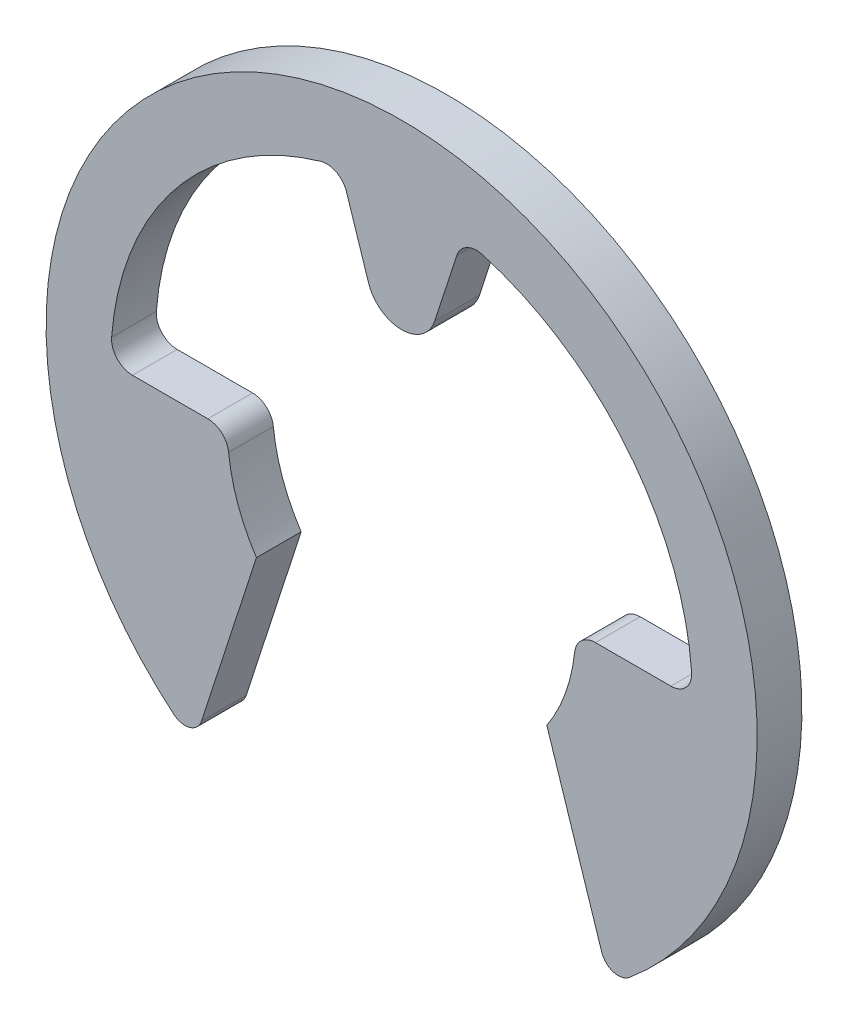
ISO-10303-21;
HEADER;
FILE_DESCRIPTION(('STEP AP214'),'2;1');
FILE_NAME('part.step','',(''),(''),'','','');
FILE_SCHEMA(('AUTOMOTIVE_DESIGN { 1 0 10303 214 1 1 1 1 }'));
ENDSEC;
DATA;
#1=APPLICATION_CONTEXT('core data for automotive mechanical design processes');
#2=APPLICATION_PROTOCOL_DEFINITION('international standard','automotive_design',2000,#1);
#3=PRODUCT_CONTEXT('',#1,'mechanical');
#4=PRODUCT('Part','Part','',(#3));
#5=PRODUCT_RELATED_PRODUCT_CATEGORY('part','',(#4));
#6=PRODUCT_DEFINITION_FORMATION('','',#4);
#7=PRODUCT_DEFINITION_CONTEXT('part definition',#1,'design');
#8=PRODUCT_DEFINITION('design','',#6,#7);
#9=PRODUCT_DEFINITION_SHAPE('','',#8);
#10=(LENGTH_UNIT() NAMED_UNIT(*) SI_UNIT(.MILLI.,.METRE.));
#11=(NAMED_UNIT(*) PLANE_ANGLE_UNIT() SI_UNIT($,.RADIAN.));
#12=(NAMED_UNIT(*) SI_UNIT($,.STERADIAN.) SOLID_ANGLE_UNIT());
#13=UNCERTAINTY_MEASURE_WITH_UNIT(LENGTH_MEASURE(1.E-05),#10,'distance_accuracy_value','');
#14=(GEOMETRIC_REPRESENTATION_CONTEXT(3) GLOBAL_UNCERTAINTY_ASSIGNED_CONTEXT((#13)) GLOBAL_UNIT_ASSIGNED_CONTEXT((#10,
#11,#12)) REPRESENTATION_CONTEXT('',''));
#15=CARTESIAN_POINT('',(0.,0.,0.));
#16=DIRECTION('',(0.,0.,1.));
#17=DIRECTION('',(1.,0.,0.));
#18=AXIS2_PLACEMENT_3D('',#15,#16,#17);
#19=CARTESIAN_POINT('',(-4.35728373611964,-5.22054388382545,0.));
#20=DIRECTION('',(0.,0.,-1.));
#21=DIRECTION('',(-1.,0.,0.));
#22=AXIS2_PLACEMENT_3D('',#19,#20,#21);
#23=PLANE('',#22);
#24=CARTESIAN_POINT('',(4.35728373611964,-5.22054388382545,0.));
#25=DIRECTION('',(0.,0.,-1.));
#26=DIRECTION('',(-1.,0.,0.));
#27=AXIS2_PLACEMENT_3D('',#24,#25,#26);
#28=CIRCLE('',#27,0.35);
#29=CARTESIAN_POINT('',(4.02441395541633,-5.32869983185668,0.));
#30=VERTEX_POINT('',#29);
#31=CARTESIAN_POINT('',(4.58155569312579,-5.48924834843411,0.));
#32=VERTEX_POINT('',#31);
#33=EDGE_CURVE('E164',#30,#32,#28,.F.);
#34=ORIENTED_EDGE('',*,*,#33,.F.);
#35=DIRECTION('',(-0.309016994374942,0.951056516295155,0.));
#36=VECTOR('',#35,1.);
#37=CARTESIAN_POINT('',(2.92,-1.92966318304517,0.));
#38=LINE('',#37,#36);
#39=CARTESIAN_POINT('',(2.92,-1.92966318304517,0.));
#40=VERTEX_POINT('',#39);
#41=EDGE_CURVE('E162',#30,#40,#38,.T.);
#42=ORIENTED_EDGE('',*,*,#41,.T.);
#43=CARTESIAN_POINT('',(0.,0.,0.));
#44=DIRECTION('',(0.,0.,-1.));
#45=DIRECTION('',(-1.,0.,0.));
#46=AXIS2_PLACEMENT_3D('',#43,#44,#45);
#47=CIRCLE('',#46,3.5);
#48=CARTESIAN_POINT('',(3.47985272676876,-0.375,0.));
#49=VERTEX_POINT('',#48);
#50=EDGE_CURVE('E20',#40,#49,#47,.F.);
#51=ORIENTED_EDGE('',*,*,#50,.T.);
#52=CARTESIAN_POINT('',(3.89743505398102,-0.42,0.));
#53=DIRECTION('',(0.,0.,-1.));
#54=DIRECTION('',(-1.,0.,0.));
#55=AXIS2_PLACEMENT_3D('',#52,#53,#54);
#56=CIRCLE('',#55,0.42);
#57=CARTESIAN_POINT('',(3.89743505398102,0.,0.));
#58=VERTEX_POINT('',#57);
#59=EDGE_CURVE('E160',#49,#58,#56,.T.);
#60=ORIENTED_EDGE('',*,*,#59,.T.);
#61=DIRECTION('',(-1.,0.,0.));
#62=VECTOR('',#61,1.);
#63=CARTESIAN_POINT('',(-4.35728373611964,0.,0.));
#64=LINE('',#63,#62);
#65=CARTESIAN_POINT('',(5.41373253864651,0.,0.));
#66=VERTEX_POINT('',#65);
#67=EDGE_CURVE('E235',#58,#66,#64,.F.);
#68=ORIENTED_EDGE('',*,*,#67,.T.);
#69=CARTESIAN_POINT('',(5.41373253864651,0.42,0.));
#70=DIRECTION('',(0.,0.,-1.));
#71=DIRECTION('',(-1.,0.,0.));
#72=AXIS2_PLACEMENT_3D('',#69,#70,#71);
#73=CIRCLE('',#72,0.42);
#74=CARTESIAN_POINT('',(5.83247428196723,0.452486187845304,0.));
#75=VERTEX_POINT('',#74);
#76=EDGE_CURVE('E233',#66,#75,#73,.F.);
#77=ORIENTED_EDGE('',*,*,#76,.T.);
#78=CARTESIAN_POINT('',(0.,0.,0.));
#79=DIRECTION('',(0.,0.,-1.));
#80=DIRECTION('',(-1.,0.,0.));
#81=AXIS2_PLACEMENT_3D('',#78,#79,#80);
#82=CIRCLE('',#81,5.85);
#83=CARTESIAN_POINT('',(1.62452889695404,5.61991155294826,0.));
#84=VERTEX_POINT('',#83);
#85=EDGE_CURVE('E230',#75,#84,#82,.F.);
#86=ORIENTED_EDGE('',*,*,#85,.T.);
#87=CARTESIAN_POINT('',(1.50789605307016,5.21643072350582,0.));
#88=DIRECTION('',(0.,0.,-1.));
#89=DIRECTION('',(-1.,0.,0.));
#90=AXIS2_PLACEMENT_3D('',#87,#88,#89);
#91=CIRCLE('',#90,0.42);
#92=CARTESIAN_POINT('',(1.10845231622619,5.34621786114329,0.));
#93=VERTEX_POINT('',#92);
#94=EDGE_CURVE('E226',#84,#93,#91,.F.);
#95=ORIENTED_EDGE('',*,*,#94,.T.);
#96=DIRECTION('',(-0.309016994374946,-0.951056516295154,0.));
#97=VECTOR('',#96,1.);
#98=CARTESIAN_POINT('',(0.665739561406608,3.98368810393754,0.));
#99=LINE('',#98,#97);
#100=CARTESIAN_POINT('',(0.665739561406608,3.98368810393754,0.));
#101=VERTEX_POINT('',#100);
#102=EDGE_CURVE('E225',#93,#101,#99,.T.);
#103=ORIENTED_EDGE('',*,*,#102,.T.);
#104=CARTESIAN_POINT('',(0.,4.2,0.));
#105=DIRECTION('',(0.,0.,-1.));
#106=DIRECTION('',(-1.,0.,0.));
#107=AXIS2_PLACEMENT_3D('',#104,#105,#106);
#108=CIRCLE('',#107,0.7);
#109=CARTESIAN_POINT('',(-0.665739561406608,3.98368810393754,0.));
#110=VERTEX_POINT('',#109);
#111=EDGE_CURVE('E221',#110,#101,#108,.F.);
#112=ORIENTED_EDGE('',*,*,#111,.F.);
#113=DIRECTION('',(-0.309016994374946,0.951056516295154,0.));
#114=VECTOR('',#113,1.);
#115=CARTESIAN_POINT('',(-0.665739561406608,3.98368810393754,0.));
#116=LINE('',#115,#114);
#117=CARTESIAN_POINT('',(-1.10845231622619,5.34621786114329,0.));
#118=VERTEX_POINT('',#117);
#119=EDGE_CURVE('E215',#110,#118,#116,.T.);
#120=ORIENTED_EDGE('',*,*,#119,.T.);
#121=CARTESIAN_POINT('',(-1.50789605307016,5.21643072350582,0.));
#122=DIRECTION('',(0.,0.,-1.));
#123=DIRECTION('',(-1.,0.,0.));
#124=AXIS2_PLACEMENT_3D('',#121,#122,#123);
#125=CIRCLE('',#124,0.42);
#126=CARTESIAN_POINT('',(-1.62452889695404,5.61991155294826,0.));
#127=VERTEX_POINT('',#126);
#128=EDGE_CURVE('E211',#118,#127,#125,.F.);
#129=ORIENTED_EDGE('',*,*,#128,.T.);
#130=CARTESIAN_POINT('',(0.,0.,0.));
#131=DIRECTION('',(0.,0.,-1.));
#132=DIRECTION('',(-1.,0.,0.));
#133=AXIS2_PLACEMENT_3D('',#130,#131,#132);
#134=CIRCLE('',#133,5.85);
#135=CARTESIAN_POINT('',(-5.83247428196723,0.452486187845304,0.));
#136=VERTEX_POINT('',#135);
#137=EDGE_CURVE('E207',#127,#136,#134,.F.);
#138=ORIENTED_EDGE('',*,*,#137,.T.);
#139=CARTESIAN_POINT('',(-5.41373253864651,0.42,0.));
#140=DIRECTION('',(0.,0.,-1.));
#141=DIRECTION('',(-1.,0.,0.));
#142=AXIS2_PLACEMENT_3D('',#139,#140,#141);
#143=CIRCLE('',#142,0.42);
#144=CARTESIAN_POINT('',(-5.41373253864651,0.,0.));
#145=VERTEX_POINT('',#144);
#146=EDGE_CURVE('E203',#136,#145,#143,.F.);
#147=ORIENTED_EDGE('',*,*,#146,.T.);
#148=DIRECTION('',(1.,0.,0.));
#149=VECTOR('',#148,1.);
#150=CARTESIAN_POINT('',(-3.5,0.,0.));
#151=LINE('',#150,#149);
#152=CARTESIAN_POINT('',(-3.89743505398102,0.,0.));
#153=VERTEX_POINT('',#152);
#154=EDGE_CURVE('E202',#145,#153,#151,.T.);
#155=ORIENTED_EDGE('',*,*,#154,.T.);
#156=CARTESIAN_POINT('',(-3.89743505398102,-0.42,0.));
#157=DIRECTION('',(0.,0.,-1.));
#158=DIRECTION('',(-1.,0.,0.));
#159=AXIS2_PLACEMENT_3D('',#156,#157,#158);
#160=CIRCLE('',#159,0.42);
#161=CARTESIAN_POINT('',(-3.47985272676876,-0.375000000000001,0.));
#162=VERTEX_POINT('',#161);
#163=EDGE_CURVE('E198',#162,#153,#160,.F.);
#164=ORIENTED_EDGE('',*,*,#163,.F.);
#165=CARTESIAN_POINT('',(0.,0.,0.));
#166=DIRECTION('',(0.,0.,-1.));
#167=DIRECTION('',(-1.,0.,0.));
#168=AXIS2_PLACEMENT_3D('',#165,#166,#167);
#169=CIRCLE('',#168,3.5);
#170=CARTESIAN_POINT('',(-2.92,-1.92966318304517,0.));
#171=VERTEX_POINT('',#170);
#172=EDGE_CURVE('E192',#162,#171,#169,.F.);
#173=ORIENTED_EDGE('',*,*,#172,.T.);
#174=DIRECTION('',(-0.309016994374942,-0.951056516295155,0.));
#175=VECTOR('',#174,1.);
#176=CARTESIAN_POINT('',(-2.92,-1.92966318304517,0.));
#177=LINE('',#176,#175);
#178=CARTESIAN_POINT('',(-4.02441395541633,-5.32869983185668,0.));
#179=VERTEX_POINT('',#178);
#180=EDGE_CURVE('E191',#171,#179,#177,.T.);
#181=ORIENTED_EDGE('',*,*,#180,.T.);
#182=CARTESIAN_POINT('',(-4.35728373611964,-5.22054388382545,0.));
#183=DIRECTION('',(0.,0.,-1.));
#184=DIRECTION('',(-1.,0.,0.));
#185=AXIS2_PLACEMENT_3D('',#182,#183,#184);
#186=CIRCLE('',#185,0.35);
#187=CARTESIAN_POINT('',(-4.58155569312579,-5.48924834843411,0.));
#188=VERTEX_POINT('',#187);
#189=EDGE_CURVE('E187',#188,#179,#186,.F.);
#190=ORIENTED_EDGE('',*,*,#189,.F.);
#191=CARTESIAN_POINT('',(0.,0.,0.));
#192=DIRECTION('',(0.,0.,-1.));
#193=DIRECTION('',(-1.,0.,0.));
#194=AXIS2_PLACEMENT_3D('',#191,#192,#193);
#195=CIRCLE('',#194,7.15);
#196=EDGE_CURVE('E184',#32,#188,#195,.F.);
#197=ORIENTED_EDGE('',*,*,#196,.F.);
#198=EDGE_LOOP('',(#34,#42,#51,#60,#68,#77,#86,#95,#103,#112,#120,#129,#138,#147,#155,#164,#173,
#181,#190,#197));
#199=FACE_BOUND('',#198,.T.);
#200=ADVANCED_FACE('F17',(#199),#23,.T.);
#201=CARTESIAN_POINT('',(5.41373253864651,0.42,0.9));
#202=DIRECTION('',(0.,0.,-1.));
#203=DIRECTION('',(-1.,0.,0.));
#204=AXIS2_PLACEMENT_3D('',#201,#202,#203);
#205=CYLINDRICAL_SURFACE('',#204,0.42);
#206=DIRECTION('',(0.,0.,-1.));
#207=VECTOR('',#206,1.);
#208=CARTESIAN_POINT('',(5.83247428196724,0.452486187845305,0.9));
#209=LINE('',#208,#207);
#210=CARTESIAN_POINT('',(5.83247428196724,0.452486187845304,0.9));
#211=VERTEX_POINT('',#210);
#212=EDGE_CURVE('E231',#211,#75,#209,.T.);
#213=ORIENTED_EDGE('',*,*,#212,.T.);
#214=ORIENTED_EDGE('',*,*,#76,.F.);
#215=DIRECTION('',(0.,0.,-1.));
#216=VECTOR('',#215,1.);
#217=CARTESIAN_POINT('',(5.41373253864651,0.,0.9));
#218=LINE('',#217,#216);
#219=CARTESIAN_POINT('',(5.41373253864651,0.,0.9));
#220=VERTEX_POINT('',#219);
#221=EDGE_CURVE('E174',#66,#220,#218,.F.);
#222=ORIENTED_EDGE('',*,*,#221,.T.);
#223=CARTESIAN_POINT('',(5.41373253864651,0.42,0.9));
#224=DIRECTION('',(0.,0.,-1.));
#225=DIRECTION('',(-1.,0.,0.));
#226=AXIS2_PLACEMENT_3D('',#223,#224,#225);
#227=CIRCLE('',#226,0.42);
#228=EDGE_CURVE('E283',#220,#211,#227,.F.);
#229=ORIENTED_EDGE('',*,*,#228,.T.);
#230=EDGE_LOOP('',(#213,#214,#222,#229));
#231=FACE_BOUND('',#230,.T.);
#232=ADVANCED_FACE('F369',(#231),#205,.F.);
#233=CARTESIAN_POINT('',(0.,0.,0.9));
#234=DIRECTION('',(0.,0.,-1.));
#235=DIRECTION('',(-1.,0.,0.));
#236=AXIS2_PLACEMENT_3D('',#233,#234,#235);
#237=CYLINDRICAL_SURFACE('',#236,5.85);
#238=DIRECTION('',(0.,0.,-1.));
#239=VECTOR('',#238,1.);
#240=CARTESIAN_POINT('',(1.62452889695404,5.61991155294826,0.9));
#241=LINE('',#240,#239);
#242=CARTESIAN_POINT('',(1.62452889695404,5.61991155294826,0.9));
#243=VERTEX_POINT('',#242);
#244=EDGE_CURVE('E227',#243,#84,#241,.T.);
#245=ORIENTED_EDGE('',*,*,#244,.T.);
#246=ORIENTED_EDGE('',*,*,#85,.F.);
#247=ORIENTED_EDGE('',*,*,#212,.F.);
#248=CARTESIAN_POINT('',(0.,0.,0.9));
#249=DIRECTION('',(0.,0.,-1.));
#250=DIRECTION('',(-1.,0.,0.));
#251=AXIS2_PLACEMENT_3D('',#248,#249,#250);
#252=CIRCLE('',#251,5.85);
#253=EDGE_CURVE('E280',#211,#243,#252,.F.);
#254=ORIENTED_EDGE('',*,*,#253,.T.);
#255=EDGE_LOOP('',(#245,#246,#247,#254));
#256=FACE_BOUND('',#255,.T.);
#257=ADVANCED_FACE('F367',(#256),#237,.F.);
#258=CARTESIAN_POINT('',(1.50789605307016,5.21643072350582,0.9));
#259=DIRECTION('',(0.,0.,-1.));
#260=DIRECTION('',(-1.,0.,0.));
#261=AXIS2_PLACEMENT_3D('',#258,#259,#260);
#262=CYLINDRICAL_SURFACE('',#261,0.42);
#263=DIRECTION('',(0.,0.,1.));
#264=VECTOR('',#263,1.);
#265=CARTESIAN_POINT('',(1.10845231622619,5.34621786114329,0.9));
#266=LINE('',#265,#264);
#267=CARTESIAN_POINT('',(1.10845231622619,5.34621786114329,0.9));
#268=VERTEX_POINT('',#267);
#269=EDGE_CURVE('E222',#268,#93,#266,.F.);
#270=ORIENTED_EDGE('',*,*,#269,.T.);
#271=ORIENTED_EDGE('',*,*,#94,.F.);
#272=ORIENTED_EDGE('',*,*,#244,.F.);
#273=CARTESIAN_POINT('',(1.50789605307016,5.21643072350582,0.9));
#274=DIRECTION('',(0.,0.,-1.));
#275=DIRECTION('',(-1.,0.,0.));
#276=AXIS2_PLACEMENT_3D('',#273,#274,#275);
#277=CIRCLE('',#276,0.42);
#278=EDGE_CURVE('E277',#243,#268,#277,.F.);
#279=ORIENTED_EDGE('',*,*,#278,.T.);
#280=EDGE_LOOP('',(#270,#271,#272,#279));
#281=FACE_BOUND('',#280,.T.);
#282=ADVANCED_FACE('F364',(#281),#262,.F.);
#283=CARTESIAN_POINT('',(0.665739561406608,3.98368810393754,0.9));
#284=DIRECTION('',(-0.951056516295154,0.309016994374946,0.));
#285=DIRECTION('',(-0.309016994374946,-0.951056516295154,0.));
#286=AXIS2_PLACEMENT_3D('',#283,#284,#285);
#287=PLANE('',#286);
#288=ORIENTED_EDGE('',*,*,#269,.F.);
#289=DIRECTION('',(-0.309016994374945,-0.951056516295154,0.));
#290=VECTOR('',#289,1.);
#291=CARTESIAN_POINT('',(1.10845231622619,5.34621786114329,0.9));
#292=LINE('',#291,#290);
#293=CARTESIAN_POINT('',(0.665739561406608,3.98368810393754,0.9));
#294=VERTEX_POINT('',#293);
#295=EDGE_CURVE('E276',#268,#294,#292,.T.);
#296=ORIENTED_EDGE('',*,*,#295,.T.);
#297=DIRECTION('',(0.,0.,-1.));
#298=VECTOR('',#297,1.);
#299=CARTESIAN_POINT('',(0.665739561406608,3.98368810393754,0.9));
#300=LINE('',#299,#298);
#301=EDGE_CURVE('E219',#101,#294,#300,.F.);
#302=ORIENTED_EDGE('',*,*,#301,.F.);
#303=ORIENTED_EDGE('',*,*,#102,.F.);
#304=EDGE_LOOP('',(#288,#296,#302,#303));
#305=FACE_BOUND('',#304,.T.);
#306=ADVANCED_FACE('F360',(#305),#287,.F.);
#307=CARTESIAN_POINT('',(0.,4.2,0.9));
#308=DIRECTION('',(0.,0.,-1.));
#309=DIRECTION('',(-1.,0.,0.));
#310=AXIS2_PLACEMENT_3D('',#307,#308,#309);
#311=CYLINDRICAL_SURFACE('',#310,0.7);
#312=CARTESIAN_POINT('',(0.,4.2,0.9));
#313=DIRECTION('',(0.,0.,-1.));
#314=DIRECTION('',(-1.,0.,0.));
#315=AXIS2_PLACEMENT_3D('',#312,#313,#314);
#316=CIRCLE('',#315,0.7);
#317=CARTESIAN_POINT('',(-0.665739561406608,3.98368810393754,0.9));
#318=VERTEX_POINT('',#317);
#319=EDGE_CURVE('E273',#294,#318,#316,.T.);
#320=ORIENTED_EDGE('',*,*,#319,.T.);
#321=DIRECTION('',(0.,0.,1.));
#322=VECTOR('',#321,1.);
#323=CARTESIAN_POINT('',(-0.665739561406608,3.98368810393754,0.9));
#324=LINE('',#323,#322);
#325=EDGE_CURVE('E216',#318,#110,#324,.F.);
#326=ORIENTED_EDGE('',*,*,#325,.T.);
#327=ORIENTED_EDGE('',*,*,#111,.T.);
#328=ORIENTED_EDGE('',*,*,#301,.T.);
#329=EDGE_LOOP('',(#320,#326,#327,#328));
#330=FACE_BOUND('',#329,.T.);
#331=ADVANCED_FACE('F355',(#330),#311,.T.);
#332=CARTESIAN_POINT('',(-0.665739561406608,3.98368810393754,0.9));
#333=DIRECTION('',(0.951056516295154,0.309016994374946,0.));
#334=DIRECTION('',(-0.309016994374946,0.951056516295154,0.));
#335=AXIS2_PLACEMENT_3D('',#332,#333,#334);
#336=PLANE('',#335);
#337=DIRECTION('',(0.,0.,-1.));
#338=VECTOR('',#337,1.);
#339=CARTESIAN_POINT('',(-1.10845231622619,5.34621786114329,0.9));
#340=LINE('',#339,#338);
#341=CARTESIAN_POINT('',(-1.10845231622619,5.34621786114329,0.9));
#342=VERTEX_POINT('',#341);
#343=EDGE_CURVE('E212',#342,#118,#340,.T.);
#344=ORIENTED_EDGE('',*,*,#343,.T.);
#345=ORIENTED_EDGE('',*,*,#119,.F.);
#346=ORIENTED_EDGE('',*,*,#325,.F.);
#347=DIRECTION('',(-0.309016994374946,0.951056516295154,0.));
#348=VECTOR('',#347,1.);
#349=CARTESIAN_POINT('',(-0.665739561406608,3.98368810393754,0.9));
#350=LINE('',#349,#348);
#351=EDGE_CURVE('E272',#318,#342,#350,.T.);
#352=ORIENTED_EDGE('',*,*,#351,.T.);
#353=EDGE_LOOP('',(#344,#345,#346,#352));
#354=FACE_BOUND('',#353,.T.);
#355=ADVANCED_FACE('F352',(#354),#336,.F.);
#356=CARTESIAN_POINT('',(-1.50789605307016,5.21643072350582,0.9));
#357=DIRECTION('',(0.,0.,-1.));
#358=DIRECTION('',(-1.,0.,0.));
#359=AXIS2_PLACEMENT_3D('',#356,#357,#358);
#360=CYLINDRICAL_SURFACE('',#359,0.42);
#361=DIRECTION('',(0.,0.,-1.));
#362=VECTOR('',#361,1.);
#363=CARTESIAN_POINT('',(-1.62452889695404,5.61991155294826,0.9));
#364=LINE('',#363,#362);
#365=CARTESIAN_POINT('',(-1.62452889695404,5.61991155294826,0.9));
#366=VERTEX_POINT('',#365);
#367=EDGE_CURVE('E208',#366,#127,#364,.T.);
#368=ORIENTED_EDGE('',*,*,#367,.T.);
#369=ORIENTED_EDGE('',*,*,#128,.F.);
#370=ORIENTED_EDGE('',*,*,#343,.F.);
#371=CARTESIAN_POINT('',(-1.50789605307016,5.21643072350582,0.9));
#372=DIRECTION('',(0.,0.,-1.));
#373=DIRECTION('',(-1.,0.,0.));
#374=AXIS2_PLACEMENT_3D('',#371,#372,#373);
#375=CIRCLE('',#374,0.42);
#376=EDGE_CURVE('E269',#342,#366,#375,.F.);
#377=ORIENTED_EDGE('',*,*,#376,.T.);
#378=EDGE_LOOP('',(#368,#369,#370,#377));
#379=FACE_BOUND('',#378,.T.);
#380=ADVANCED_FACE('F348',(#379),#360,.F.);
#381=CARTESIAN_POINT('',(0.,0.,0.9));
#382=DIRECTION('',(0.,0.,-1.));
#383=DIRECTION('',(-1.,0.,0.));
#384=AXIS2_PLACEMENT_3D('',#381,#382,#383);
#385=CYLINDRICAL_SURFACE('',#384,5.85);
#386=ORIENTED_EDGE('',*,*,#367,.F.);
#387=CARTESIAN_POINT('',(0.,0.,0.9));
#388=DIRECTION('',(0.,0.,-1.));
#389=DIRECTION('',(-1.,0.,0.));
#390=AXIS2_PLACEMENT_3D('',#387,#388,#389);
#391=CIRCLE('',#390,5.85);
#392=CARTESIAN_POINT('',(-5.83247428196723,0.452486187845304,0.9));
#393=VERTEX_POINT('',#392);
#394=EDGE_CURVE('E266',#366,#393,#391,.F.);
#395=ORIENTED_EDGE('',*,*,#394,.T.);
#396=DIRECTION('',(0.,0.,-1.));
#397=VECTOR('',#396,1.);
#398=CARTESIAN_POINT('',(-5.83247428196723,0.452486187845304,0.9));
#399=LINE('',#398,#397);
#400=EDGE_CURVE('E204',#393,#136,#399,.T.);
#401=ORIENTED_EDGE('',*,*,#400,.T.);
#402=ORIENTED_EDGE('',*,*,#137,.F.);
#403=EDGE_LOOP('',(#386,#395,#401,#402));
#404=FACE_BOUND('',#403,.T.);
#405=ADVANCED_FACE('F344',(#404),#385,.F.);
#406=CARTESIAN_POINT('',(-5.41373253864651,0.42,0.9));
#407=DIRECTION('',(0.,0.,-1.));
#408=DIRECTION('',(-1.,0.,0.));
#409=AXIS2_PLACEMENT_3D('',#406,#407,#408);
#410=CYLINDRICAL_SURFACE('',#409,0.42);
#411=CARTESIAN_POINT('',(-5.41373253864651,0.42,0.9));
#412=DIRECTION('',(0.,0.,-1.));
#413=DIRECTION('',(-1.,0.,0.));
#414=AXIS2_PLACEMENT_3D('',#411,#412,#413);
#415=CIRCLE('',#414,0.42);
#416=CARTESIAN_POINT('',(-5.41373253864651,0.,0.9));
#417=VERTEX_POINT('',#416);
#418=EDGE_CURVE('E264',#393,#417,#415,.F.);
#419=ORIENTED_EDGE('',*,*,#418,.T.);
#420=DIRECTION('',(0.,0.,-1.));
#421=VECTOR('',#420,1.);
#422=CARTESIAN_POINT('',(-5.41373253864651,0.,0.9));
#423=LINE('',#422,#421);
#424=EDGE_CURVE('E199',#417,#145,#423,.T.);
#425=ORIENTED_EDGE('',*,*,#424,.T.);
#426=ORIENTED_EDGE('',*,*,#146,.F.);
#427=ORIENTED_EDGE('',*,*,#400,.F.);
#428=EDGE_LOOP('',(#419,#425,#426,#427));
#429=FACE_BOUND('',#428,.T.);
#430=ADVANCED_FACE('F340',(#429),#410,.F.);
#431=CARTESIAN_POINT('',(-3.5,0.,0.9));
#432=DIRECTION('',(0.,-1.,0.));
#433=DIRECTION('',(0.,0.,-1.));
#434=AXIS2_PLACEMENT_3D('',#431,#432,#433);
#435=PLANE('',#434);
#436=DIRECTION('',(0.,0.,-1.));
#437=VECTOR('',#436,1.);
#438=CARTESIAN_POINT('',(-3.89743505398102,0.,0.9));
#439=LINE('',#438,#437);
#440=CARTESIAN_POINT('',(-3.89743505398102,0.,0.9));
#441=VERTEX_POINT('',#440);
#442=EDGE_CURVE('E196',#153,#441,#439,.F.);
#443=ORIENTED_EDGE('',*,*,#442,.F.);
#444=ORIENTED_EDGE('',*,*,#154,.F.);
#445=ORIENTED_EDGE('',*,*,#424,.F.);
#446=DIRECTION('',(-1.,0.,0.));
#447=VECTOR('',#446,1.);
#448=CARTESIAN_POINT('',(-4.35728373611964,0.,0.9));
#449=LINE('',#448,#447);
#450=EDGE_CURVE('E263',#417,#441,#449,.F.);
#451=ORIENTED_EDGE('',*,*,#450,.T.);
#452=EDGE_LOOP('',(#443,#444,#445,#451));
#453=FACE_BOUND('',#452,.T.);
#454=ADVANCED_FACE('F337',(#453),#435,.F.);
#455=CARTESIAN_POINT('',(-3.89743505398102,-0.42,0.9));
#456=DIRECTION('',(0.,0.,-1.));
#457=DIRECTION('',(-1.,0.,0.));
#458=AXIS2_PLACEMENT_3D('',#455,#456,#457);
#459=CYLINDRICAL_SURFACE('',#458,0.42);
#460=ORIENTED_EDGE('',*,*,#163,.T.);
#461=ORIENTED_EDGE('',*,*,#442,.T.);
#462=CARTESIAN_POINT('',(-3.89743505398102,-0.42,0.9));
#463=DIRECTION('',(0.,0.,-1.));
#464=DIRECTION('',(-1.,0.,0.));
#465=AXIS2_PLACEMENT_3D('',#462,#463,#464);
#466=CIRCLE('',#465,0.42);
#467=CARTESIAN_POINT('',(-3.47985272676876,-0.375000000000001,0.9));
#468=VERTEX_POINT('',#467);
#469=EDGE_CURVE('E260',#441,#468,#466,.T.);
#470=ORIENTED_EDGE('',*,*,#469,.T.);
#471=DIRECTION('',(0.,0.,-1.));
#472=VECTOR('',#471,1.);
#473=CARTESIAN_POINT('',(-3.47985272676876,-0.375000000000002,0.9));
#474=LINE('',#473,#472);
#475=EDGE_CURVE('E193',#468,#162,#474,.T.);
#476=ORIENTED_EDGE('',*,*,#475,.T.);
#477=EDGE_LOOP('',(#460,#461,#470,#476));
#478=FACE_BOUND('',#477,.T.);
#479=ADVANCED_FACE('F331',(#478),#459,.T.);
#480=CARTESIAN_POINT('',(0.,0.,0.9));
#481=DIRECTION('',(0.,0.,-1.));
#482=DIRECTION('',(-1.,0.,0.));
#483=AXIS2_PLACEMENT_3D('',#480,#481,#482);
#484=CYLINDRICAL_SURFACE('',#483,3.5);
#485=ORIENTED_EDGE('',*,*,#475,.F.);
#486=CARTESIAN_POINT('',(0.,0.,0.9));
#487=DIRECTION('',(0.,0.,-1.));
#488=DIRECTION('',(-1.,0.,0.));
#489=AXIS2_PLACEMENT_3D('',#486,#487,#488);
#490=CIRCLE('',#489,3.5);
#491=CARTESIAN_POINT('',(-2.92,-1.92966318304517,0.9));
#492=VERTEX_POINT('',#491);
#493=EDGE_CURVE('E257',#468,#492,#490,.F.);
#494=ORIENTED_EDGE('',*,*,#493,.T.);
#495=DIRECTION('',(0.,0.,1.));
#496=VECTOR('',#495,1.);
#497=CARTESIAN_POINT('',(-2.92,-1.92966318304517,0.9));
#498=LINE('',#497,#496);
#499=EDGE_CURVE('E188',#492,#171,#498,.F.);
#500=ORIENTED_EDGE('',*,*,#499,.T.);
#501=ORIENTED_EDGE('',*,*,#172,.F.);
#502=EDGE_LOOP('',(#485,#494,#500,#501));
#503=FACE_BOUND('',#502,.T.);
#504=ADVANCED_FACE('F328',(#503),#484,.F.);
#505=CARTESIAN_POINT('',(-2.92,-1.92966318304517,0.9));
#506=DIRECTION('',(-0.951056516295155,0.309016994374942,0.));
#507=DIRECTION('',(-0.309016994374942,-0.951056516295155,0.));
#508=AXIS2_PLACEMENT_3D('',#505,#506,#507);
#509=PLANE('',#508);
#510=ORIENTED_EDGE('',*,*,#499,.F.);
#511=DIRECTION('',(-0.309016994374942,-0.951056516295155,0.));
#512=VECTOR('',#511,1.);
#513=CARTESIAN_POINT('',(-2.92,-1.92966318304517,0.9));
#514=LINE('',#513,#512);
#515=CARTESIAN_POINT('',(-4.02441395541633,-5.32869983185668,0.9));
#516=VERTEX_POINT('',#515);
#517=EDGE_CURVE('E256',#492,#516,#514,.T.);
#518=ORIENTED_EDGE('',*,*,#517,.T.);
#519=DIRECTION('',(0.,0.,-1.));
#520=VECTOR('',#519,1.);
#521=CARTESIAN_POINT('',(-4.02441395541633,-5.32869983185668,0.9));
#522=LINE('',#521,#520);
#523=EDGE_CURVE('E185',#179,#516,#522,.F.);
#524=ORIENTED_EDGE('',*,*,#523,.F.);
#525=ORIENTED_EDGE('',*,*,#180,.F.);
#526=EDGE_LOOP('',(#510,#518,#524,#525));
#527=FACE_BOUND('',#526,.T.);
#528=ADVANCED_FACE('F319',(#527),#509,.F.);
#529=CARTESIAN_POINT('',(-4.35728373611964,-5.22054388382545,0.9));
#530=DIRECTION('',(0.,0.,-1.));
#531=DIRECTION('',(-1.,0.,0.));
#532=AXIS2_PLACEMENT_3D('',#529,#530,#531);
#533=CYLINDRICAL_SURFACE('',#532,0.35);
#534=CARTESIAN_POINT('',(-4.35728373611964,-5.22054388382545,0.9));
#535=DIRECTION('',(0.,0.,-1.));
#536=DIRECTION('',(-1.,0.,0.));
#537=AXIS2_PLACEMENT_3D('',#534,#535,#536);
#538=CIRCLE('',#537,0.35);
#539=CARTESIAN_POINT('',(-4.58155569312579,-5.48924834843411,0.9));
#540=VERTEX_POINT('',#539);
#541=EDGE_CURVE('E253',#516,#540,#538,.T.);
#542=ORIENTED_EDGE('',*,*,#541,.T.);
#543=DIRECTION('',(0.,0.,-1.));
#544=VECTOR('',#543,1.);
#545=CARTESIAN_POINT('',(-4.58155569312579,-5.48924834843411,0.9));
#546=LINE('',#545,#544);
#547=EDGE_CURVE('E182',#188,#540,#546,.F.);
#548=ORIENTED_EDGE('',*,*,#547,.F.);
#549=ORIENTED_EDGE('',*,*,#189,.T.);
#550=ORIENTED_EDGE('',*,*,#523,.T.);
#551=EDGE_LOOP('',(#542,#548,#549,#550));
#552=FACE_BOUND('',#551,.T.);
#553=ADVANCED_FACE('F379',(#552),#533,.T.);
#554=CARTESIAN_POINT('',(0.,0.,0.9));
#555=DIRECTION('',(0.,0.,-1.));
#556=DIRECTION('',(-1.,0.,0.));
#557=AXIS2_PLACEMENT_3D('',#554,#555,#556);
#558=CYLINDRICAL_SURFACE('',#557,7.15);
#559=DIRECTION('',(0.,0.,-1.));
#560=VECTOR('',#559,1.);
#561=CARTESIAN_POINT('',(4.58155569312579,-5.48924834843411,0.9));
#562=LINE('',#561,#560);
#563=CARTESIAN_POINT('',(4.58155569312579,-5.48924834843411,0.9));
#564=VERTEX_POINT('',#563);
#565=EDGE_CURVE('E179',#32,#564,#562,.F.);
#566=ORIENTED_EDGE('',*,*,#565,.F.);
#567=ORIENTED_EDGE('',*,*,#196,.T.);
#568=ORIENTED_EDGE('',*,*,#547,.T.);
#569=CARTESIAN_POINT('',(0.,0.,0.9));
#570=DIRECTION('',(0.,0.,-1.));
#571=DIRECTION('',(-1.,0.,0.));
#572=AXIS2_PLACEMENT_3D('',#569,#570,#571);
#573=CIRCLE('',#572,7.15);
#574=EDGE_CURVE('E251',#540,#564,#573,.T.);
#575=ORIENTED_EDGE('',*,*,#574,.T.);
#576=EDGE_LOOP('',(#566,#567,#568,#575));
#577=FACE_BOUND('',#576,.T.);
#578=ADVANCED_FACE('F375',(#577),#558,.T.);
#579=CARTESIAN_POINT('',(4.35728373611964,-5.22054388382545,0.9));
#580=DIRECTION('',(0.,0.,-1.));
#581=DIRECTION('',(-1.,0.,0.));
#582=AXIS2_PLACEMENT_3D('',#579,#580,#581);
#583=CYLINDRICAL_SURFACE('',#582,0.35);
#584=CARTESIAN_POINT('',(4.35728373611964,-5.22054388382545,0.9));
#585=DIRECTION('',(0.,0.,-1.));
#586=DIRECTION('',(-1.,0.,0.));
#587=AXIS2_PLACEMENT_3D('',#584,#585,#586);
#588=CIRCLE('',#587,0.35);
#589=CARTESIAN_POINT('',(4.02441395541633,-5.32869983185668,0.9));
#590=VERTEX_POINT('',#589);
#591=EDGE_CURVE('E248',#564,#590,#588,.T.);
#592=ORIENTED_EDGE('',*,*,#591,.T.);
#593=DIRECTION('',(0.,0.,1.));
#594=VECTOR('',#593,1.);
#595=CARTESIAN_POINT('',(4.02441395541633,-5.32869983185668,0.9));
#596=LINE('',#595,#594);
#597=EDGE_CURVE('E167',#590,#30,#596,.F.);
#598=ORIENTED_EDGE('',*,*,#597,.T.);
#599=ORIENTED_EDGE('',*,*,#33,.T.);
#600=ORIENTED_EDGE('',*,*,#565,.T.);
#601=EDGE_LOOP('',(#592,#598,#599,#600));
#602=FACE_BOUND('',#601,.T.);
#603=ADVANCED_FACE('F372',(#602),#583,.T.);
#604=CARTESIAN_POINT('',(2.92,-1.92966318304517,0.9));
#605=DIRECTION('',(0.951056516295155,0.309016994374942,0.));
#606=DIRECTION('',(-0.309016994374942,0.951056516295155,0.));
#607=AXIS2_PLACEMENT_3D('',#604,#605,#606);
#608=PLANE('',#607);
#609=ORIENTED_EDGE('',*,*,#597,.F.);
#610=DIRECTION('',(-0.309016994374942,0.951056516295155,0.));
#611=VECTOR('',#610,1.);
#612=CARTESIAN_POINT('',(4.02441395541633,-5.32869983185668,0.9));
#613=LINE('',#612,#611);
#614=CARTESIAN_POINT('',(2.92,-1.92966318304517,0.9));
#615=VERTEX_POINT('',#614);
#616=EDGE_CURVE('E172',#590,#615,#613,.T.);
#617=ORIENTED_EDGE('',*,*,#616,.T.);
#618=DIRECTION('',(0.,0.,-1.));
#619=VECTOR('',#618,1.);
#620=CARTESIAN_POINT('',(2.92,-1.92966318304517,0.9));
#621=LINE('',#620,#619);
#622=EDGE_CURVE('E155',#615,#40,#621,.T.);
#623=ORIENTED_EDGE('',*,*,#622,.T.);
#624=ORIENTED_EDGE('',*,*,#41,.F.);
#625=EDGE_LOOP('',(#609,#617,#623,#624));
#626=FACE_BOUND('',#625,.T.);
#627=ADVANCED_FACE('F170',(#626),#608,.F.);
#628=CARTESIAN_POINT('',(0.,0.,0.9));
#629=DIRECTION('',(0.,0.,-1.));
#630=DIRECTION('',(-1.,0.,0.));
#631=AXIS2_PLACEMENT_3D('',#628,#629,#630);
#632=CYLINDRICAL_SURFACE('',#631,3.5);
#633=DIRECTION('',(0.,0.,-1.));
#634=VECTOR('',#633,1.);
#635=CARTESIAN_POINT('',(3.47985272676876,-0.375,0.9));
#636=LINE('',#635,#634);
#637=CARTESIAN_POINT('',(3.47985272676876,-0.375,0.9));
#638=VERTEX_POINT('',#637);
#639=EDGE_CURVE('E157',#49,#638,#636,.F.);
#640=ORIENTED_EDGE('',*,*,#639,.F.);
#641=ORIENTED_EDGE('',*,*,#50,.F.);
#642=ORIENTED_EDGE('',*,*,#622,.F.);
#643=CARTESIAN_POINT('',(0.,0.,0.9));
#644=DIRECTION('',(0.,0.,-1.));
#645=DIRECTION('',(-1.,0.,0.));
#646=AXIS2_PLACEMENT_3D('',#643,#644,#645);
#647=CIRCLE('',#646,3.5);
#648=EDGE_CURVE('E246',#615,#638,#647,.F.);
#649=ORIENTED_EDGE('',*,*,#648,.T.);
#650=EDGE_LOOP('',(#640,#641,#642,#649));
#651=FACE_BOUND('',#650,.T.);
#652=ADVANCED_FACE('F152',(#651),#632,.F.);
#653=CARTESIAN_POINT('',(3.89743505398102,-0.42,0.9));
#654=DIRECTION('',(0.,0.,-1.));
#655=DIRECTION('',(-1.,0.,0.));
#656=AXIS2_PLACEMENT_3D('',#653,#654,#655);
#657=CYLINDRICAL_SURFACE('',#656,0.42);
#658=ORIENTED_EDGE('',*,*,#59,.F.);
#659=ORIENTED_EDGE('',*,*,#639,.T.);
#660=CARTESIAN_POINT('',(3.89743505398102,-0.42,0.9));
#661=DIRECTION('',(0.,0.,-1.));
#662=DIRECTION('',(-1.,0.,0.));
#663=AXIS2_PLACEMENT_3D('',#660,#661,#662);
#664=CIRCLE('',#663,0.42);
#665=CARTESIAN_POINT('',(3.89743505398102,0.,0.9));
#666=VERTEX_POINT('',#665);
#667=EDGE_CURVE('E26',#638,#666,#664,.T.);
#668=ORIENTED_EDGE('',*,*,#667,.T.);
#669=DIRECTION('',(0.,0.,-1.));
#670=VECTOR('',#669,1.);
#671=CARTESIAN_POINT('',(3.89743505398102,0.,0.9));
#672=LINE('',#671,#670);
#673=EDGE_CURVE('E34',#666,#58,#672,.T.);
#674=ORIENTED_EDGE('',*,*,#673,.T.);
#675=EDGE_LOOP('',(#658,#659,#668,#674));
#676=FACE_BOUND('',#675,.T.);
#677=ADVANCED_FACE('F300',(#676),#657,.T.);
#678=CARTESIAN_POINT('',(3.5,0.,0.9));
#679=DIRECTION('',(0.,-1.,0.));
#680=DIRECTION('',(0.,0.,-1.));
#681=AXIS2_PLACEMENT_3D('',#678,#679,#680);
#682=PLANE('',#681);
#683=ORIENTED_EDGE('',*,*,#673,.F.);
#684=DIRECTION('',(-1.,0.,0.));
#685=VECTOR('',#684,1.);
#686=CARTESIAN_POINT('',(-4.35728373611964,0.,0.9));
#687=LINE('',#686,#685);
#688=EDGE_CURVE('E11',#666,#220,#687,.F.);
#689=ORIENTED_EDGE('',*,*,#688,.T.);
#690=ORIENTED_EDGE('',*,*,#221,.F.);
#691=ORIENTED_EDGE('',*,*,#67,.F.);
#692=EDGE_LOOP('',(#683,#689,#690,#691));
#693=FACE_BOUND('',#692,.T.);
#694=ADVANCED_FACE('F304',(#693),#682,.F.);
#695=CARTESIAN_POINT('',(-4.35728373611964,-5.22054388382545,0.9));
#696=DIRECTION('',(0.,0.,-1.));
#697=DIRECTION('',(-1.,0.,0.));
#698=AXIS2_PLACEMENT_3D('',#695,#696,#697);
#699=PLANE('',#698);
#700=ORIENTED_EDGE('',*,*,#667,.F.);
#701=ORIENTED_EDGE('',*,*,#648,.F.);
#702=ORIENTED_EDGE('',*,*,#616,.F.);
#703=ORIENTED_EDGE('',*,*,#591,.F.);
#704=ORIENTED_EDGE('',*,*,#574,.F.);
#705=ORIENTED_EDGE('',*,*,#541,.F.);
#706=ORIENTED_EDGE('',*,*,#517,.F.);
#707=ORIENTED_EDGE('',*,*,#493,.F.);
#708=ORIENTED_EDGE('',*,*,#469,.F.);
#709=ORIENTED_EDGE('',*,*,#450,.F.);
#710=ORIENTED_EDGE('',*,*,#418,.F.);
#711=ORIENTED_EDGE('',*,*,#394,.F.);
#712=ORIENTED_EDGE('',*,*,#376,.F.);
#713=ORIENTED_EDGE('',*,*,#351,.F.);
#714=ORIENTED_EDGE('',*,*,#319,.F.);
#715=ORIENTED_EDGE('',*,*,#295,.F.);
#716=ORIENTED_EDGE('',*,*,#278,.F.);
#717=ORIENTED_EDGE('',*,*,#253,.F.);
#718=ORIENTED_EDGE('',*,*,#228,.F.);
#719=ORIENTED_EDGE('',*,*,#688,.F.);
#720=EDGE_LOOP('',(#700,#701,#702,#703,#704,#705,#706,#707,#708,#709,#710,#711,#712,#713,#714,
#715,#716,#717,#718,#719));
#721=FACE_BOUND('',#720,.T.);
#722=ADVANCED_FACE('F324',(#721),#699,.F.);
#723=CLOSED_SHELL('',(#200,#232,#257,#282,#306,#331,#355,#380,#405,#430,#454,#479,#504,#528,
#553,#578,#603,#627,#652,#677,#694,#722));
#724=MANIFOLD_SOLID_BREP('B1',#723);
#725=ADVANCED_BREP_SHAPE_REPRESENTATION('',(#18,#724),#14);
#726=SHAPE_DEFINITION_REPRESENTATION(#9,#725);
ENDSEC;
END-ISO-10303-21;
